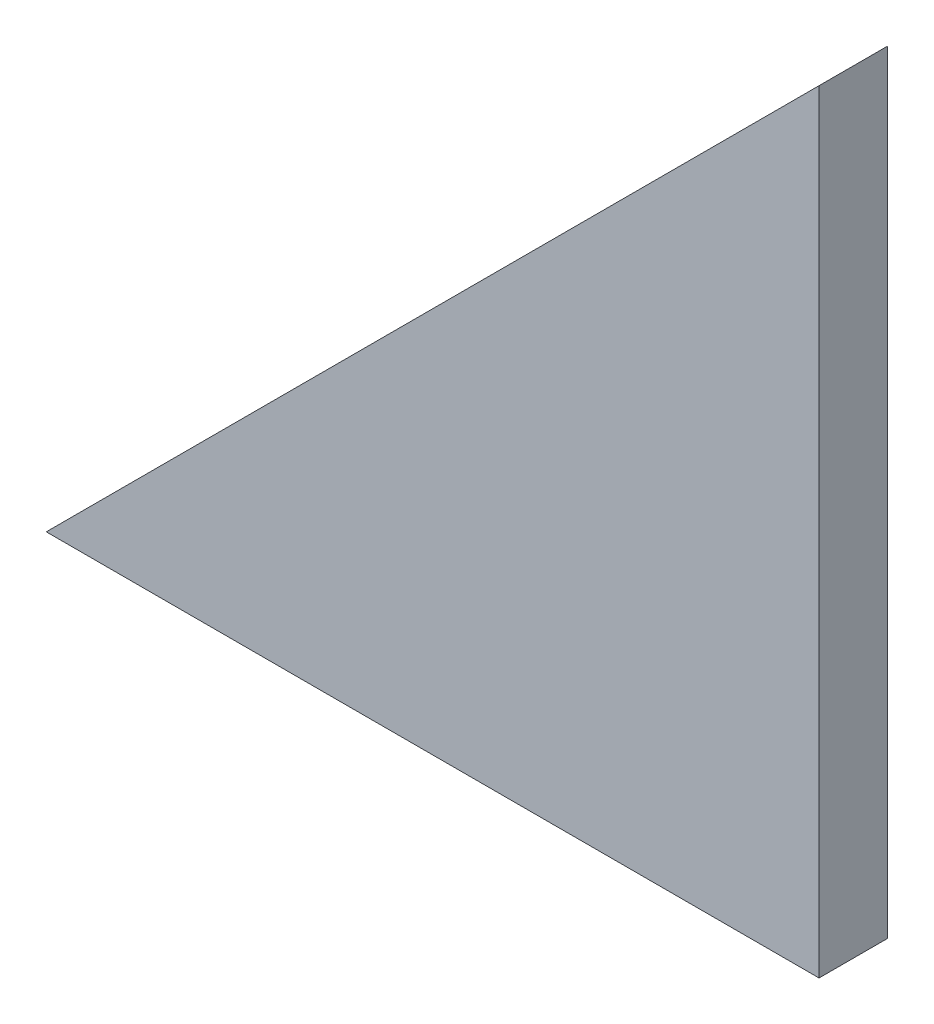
ISO-10303-21;
HEADER;
FILE_DESCRIPTION(('STEP AP214'),'2;1');
FILE_NAME('part.step','',(''),(''),'','','');
FILE_SCHEMA(('AUTOMOTIVE_DESIGN { 1 0 10303 214 1 1 1 1 }'));
ENDSEC;
DATA;
#1=APPLICATION_CONTEXT('core data for automotive mechanical design processes');
#2=APPLICATION_PROTOCOL_DEFINITION('international standard','automotive_design',2000,#1);
#3=PRODUCT_CONTEXT('',#1,'mechanical');
#4=PRODUCT('Part','Part','',(#3));
#5=PRODUCT_RELATED_PRODUCT_CATEGORY('part','',(#4));
#6=PRODUCT_DEFINITION_FORMATION('','',#4);
#7=PRODUCT_DEFINITION_CONTEXT('part definition',#1,'design');
#8=PRODUCT_DEFINITION('design','',#6,#7);
#9=PRODUCT_DEFINITION_SHAPE('','',#8);
#10=(LENGTH_UNIT() NAMED_UNIT(*) SI_UNIT(.MILLI.,.METRE.));
#11=(NAMED_UNIT(*) PLANE_ANGLE_UNIT() SI_UNIT($,.RADIAN.));
#12=(NAMED_UNIT(*) SI_UNIT($,.STERADIAN.) SOLID_ANGLE_UNIT());
#13=UNCERTAINTY_MEASURE_WITH_UNIT(LENGTH_MEASURE(1.E-05),#10,'distance_accuracy_value','');
#14=(GEOMETRIC_REPRESENTATION_CONTEXT(3) GLOBAL_UNCERTAINTY_ASSIGNED_CONTEXT((#13)) GLOBAL_UNIT_ASSIGNED_CONTEXT((#10,
#11,#12)) REPRESENTATION_CONTEXT('',''));
#15=CARTESIAN_POINT('',(0.,0.,0.));
#16=DIRECTION('',(0.,0.,1.));
#17=DIRECTION('',(1.,0.,0.));
#18=AXIS2_PLACEMENT_3D('',#15,#16,#17);
#19=CARTESIAN_POINT('',(90.,89.9999999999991,8.));
#20=DIRECTION('',(0.707106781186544,-0.707106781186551,0.));
#21=DIRECTION('',(0.707106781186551,0.707106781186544,0.));
#22=AXIS2_PLACEMENT_3D('',#19,#20,#21);
#23=PLANE('',#22);
#24=CARTESIAN_POINT('',(24.7487373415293,24.748737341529,4.));
#25=DIRECTION('',(-0.707106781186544,0.707106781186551,0.));
#26=DIRECTION('',(-0.707106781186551,-0.707106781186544,0.));
#27=AXIS2_PLACEMENT_3D('',#24,#25,#26);
#28=CIRCLE('',#27,2.1);
#29=CARTESIAN_POINT('',(23.2638131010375,23.2638131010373,4.));
#30=VERTEX_POINT('',#29);
#31=EDGE_CURVE('E125',#30,#30,#28,.T.);
#32=ORIENTED_EDGE('',*,*,#31,.F.);
#33=EDGE_LOOP('',(#32));
#34=FACE_BOUND('',#33,.T.);
#35=CARTESIAN_POINT('',(77.7817459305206,77.7817459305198,4.));
#36=DIRECTION('',(-0.707106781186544,0.707106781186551,0.));
#37=DIRECTION('',(-0.707106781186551,-0.707106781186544,0.));
#38=AXIS2_PLACEMENT_3D('',#35,#36,#37);
#39=CIRCLE('',#38,2.1);
#40=CARTESIAN_POINT('',(76.2968216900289,76.2968216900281,4.));
#41=VERTEX_POINT('',#40);
#42=EDGE_CURVE('E132',#41,#41,#39,.T.);
#43=ORIENTED_EDGE('',*,*,#42,.F.);
#44=EDGE_LOOP('',(#43));
#45=FACE_BOUND('',#44,.T.);
#46=DIRECTION('',(-0.707106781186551,-0.707106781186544,0.));
#47=VECTOR('',#46,1.);
#48=CARTESIAN_POINT('',(90.,89.9999999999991,0.));
#49=LINE('',#48,#47);
#50=CARTESIAN_POINT('',(90.,89.9999999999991,0.));
#51=VERTEX_POINT('',#50);
#52=CARTESIAN_POINT('',(0.,0.,0.));
#53=VERTEX_POINT('',#52);
#54=EDGE_CURVE('E138',#51,#53,#49,.T.);
#55=ORIENTED_EDGE('',*,*,#54,.T.);
#56=DIRECTION('',(0.,0.,-1.));
#57=VECTOR('',#56,1.);
#58=CARTESIAN_POINT('',(0.,0.,8.));
#59=LINE('',#58,#57);
#60=CARTESIAN_POINT('',(0.,0.,8.));
#61=VERTEX_POINT('',#60);
#62=EDGE_CURVE('E13',#61,#53,#59,.T.);
#63=ORIENTED_EDGE('',*,*,#62,.F.);
#64=DIRECTION('',(-0.707106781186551,-0.707106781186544,0.));
#65=VECTOR('',#64,1.);
#66=CARTESIAN_POINT('',(90.,89.9999999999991,8.));
#67=LINE('',#66,#65);
#68=CARTESIAN_POINT('',(90.,89.9999999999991,8.));
#69=VERTEX_POINT('',#68);
#70=EDGE_CURVE('E139',#69,#61,#67,.T.);
#71=ORIENTED_EDGE('',*,*,#70,.F.);
#72=DIRECTION('',(0.,0.,-1.));
#73=VECTOR('',#72,1.);
#74=CARTESIAN_POINT('',(90.,89.9999999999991,8.));
#75=LINE('',#74,#73);
#76=EDGE_CURVE('E144',#69,#51,#75,.T.);
#77=ORIENTED_EDGE('',*,*,#76,.T.);
#78=EDGE_LOOP('',(#55,#63,#71,#77));
#79=FACE_BOUND('',#78,.T.);
#80=ADVANCED_FACE('F54',(#34,#45,#79),#23,.F.);
#81=CARTESIAN_POINT('',(0.,0.,8.));
#82=DIRECTION('',(0.,1.,0.));
#83=DIRECTION('',(0.,0.,1.));
#84=AXIS2_PLACEMENT_3D('',#81,#82,#83);
#85=PLANE('',#84);
#86=CARTESIAN_POINT('',(25.5,0.,4.));
#87=DIRECTION('',(0.,-1.,0.));
#88=DIRECTION('',(0.,0.,-1.));
#89=AXIS2_PLACEMENT_3D('',#86,#87,#88);
#90=CIRCLE('',#89,2.09999999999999);
#91=CARTESIAN_POINT('',(25.5,0.,1.90000000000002));
#92=VERTEX_POINT('',#91);
#93=EDGE_CURVE('E115',#92,#92,#90,.T.);
#94=ORIENTED_EDGE('',*,*,#93,.F.);
#95=EDGE_LOOP('',(#94));
#96=FACE_BOUND('',#95,.T.);
#97=CARTESIAN_POINT('',(55.5,0.,4.00000000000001));
#98=DIRECTION('',(0.,-1.,0.));
#99=DIRECTION('',(0.,0.,-1.));
#100=AXIS2_PLACEMENT_3D('',#97,#98,#99);
#101=CIRCLE('',#100,2.09999999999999);
#102=CARTESIAN_POINT('',(55.5,0.,1.90000000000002));
#103=VERTEX_POINT('',#102);
#104=EDGE_CURVE('E114',#103,#103,#101,.T.);
#105=ORIENTED_EDGE('',*,*,#104,.F.);
#106=EDGE_LOOP('',(#105));
#107=FACE_BOUND('',#106,.T.);
#108=DIRECTION('',(1.,0.,0.));
#109=VECTOR('',#108,1.);
#110=CARTESIAN_POINT('',(0.,0.,0.));
#111=LINE('',#110,#109);
#112=CARTESIAN_POINT('',(90.,0.,0.));
#113=VERTEX_POINT('',#112);
#114=EDGE_CURVE('E83',#53,#113,#111,.T.);
#115=ORIENTED_EDGE('',*,*,#114,.T.);
#116=DIRECTION('',(0.,0.,-1.));
#117=VECTOR('',#116,1.);
#118=CARTESIAN_POINT('',(90.,0.,8.));
#119=LINE('',#118,#117);
#120=CARTESIAN_POINT('',(90.,0.,8.));
#121=VERTEX_POINT('',#120);
#122=EDGE_CURVE('E62',#121,#113,#119,.T.);
#123=ORIENTED_EDGE('',*,*,#122,.F.);
#124=DIRECTION('',(1.,0.,0.));
#125=VECTOR('',#124,1.);
#126=CARTESIAN_POINT('',(0.,0.,8.));
#127=LINE('',#126,#125);
#128=EDGE_CURVE('E91',#61,#121,#127,.T.);
#129=ORIENTED_EDGE('',*,*,#128,.F.);
#130=ORIENTED_EDGE('',*,*,#62,.T.);
#131=EDGE_LOOP('',(#115,#123,#129,#130));
#132=FACE_BOUND('',#131,.T.);
#133=ADVANCED_FACE('F166',(#96,#107,#132),#85,.F.);
#134=CARTESIAN_POINT('',(90.,0.,8.));
#135=DIRECTION('',(-1.,0.,0.));
#136=DIRECTION('',(0.,0.,1.));
#137=AXIS2_PLACEMENT_3D('',#134,#135,#136);
#138=PLANE('',#137);
#139=DIRECTION('',(0.,1.,0.));
#140=VECTOR('',#139,1.);
#141=CARTESIAN_POINT('',(90.,0.,0.));
#142=LINE('',#141,#140);
#143=EDGE_CURVE('E88',#113,#51,#142,.T.);
#144=ORIENTED_EDGE('',*,*,#143,.T.);
#145=ORIENTED_EDGE('',*,*,#76,.F.);
#146=DIRECTION('',(0.,1.,0.));
#147=VECTOR('',#146,1.);
#148=CARTESIAN_POINT('',(90.,0.,8.));
#149=LINE('',#148,#147);
#150=EDGE_CURVE('E70',#121,#69,#149,.T.);
#151=ORIENTED_EDGE('',*,*,#150,.F.);
#152=ORIENTED_EDGE('',*,*,#122,.T.);
#153=EDGE_LOOP('',(#144,#145,#151,#152));
#154=FACE_BOUND('',#153,.T.);
#155=ADVANCED_FACE('F150',(#154),#138,.F.);
#156=CARTESIAN_POINT('',(0.,0.,8.));
#157=DIRECTION('',(0.,0.,1.));
#158=DIRECTION('',(1.,0.,0.));
#159=AXIS2_PLACEMENT_3D('',#156,#157,#158);
#160=PLANE('',#159);
#161=ORIENTED_EDGE('',*,*,#70,.T.);
#162=ORIENTED_EDGE('',*,*,#128,.T.);
#163=ORIENTED_EDGE('',*,*,#150,.T.);
#164=EDGE_LOOP('',(#161,#162,#163));
#165=FACE_BOUND('',#164,.T.);
#166=ADVANCED_FACE('F157',(#165),#160,.T.);
#167=CARTESIAN_POINT('',(0.,0.,0.));
#168=DIRECTION('',(0.,0.,1.));
#169=DIRECTION('',(1.,0.,0.));
#170=AXIS2_PLACEMENT_3D('',#167,#168,#169);
#171=PLANE('',#170);
#172=ORIENTED_EDGE('',*,*,#54,.F.);
#173=ORIENTED_EDGE('',*,*,#143,.F.);
#174=ORIENTED_EDGE('',*,*,#114,.F.);
#175=EDGE_LOOP('',(#172,#173,#174));
#176=FACE_BOUND('',#175,.T.);
#177=ADVANCED_FACE('F153',(#176),#171,.F.);
#178=CARTESIAN_POINT('',(87.6812408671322,67.8822509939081,4.));
#179=DIRECTION('',(-0.707106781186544,0.707106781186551,0.));
#180=DIRECTION('',(-0.707106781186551,-0.707106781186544,0.));
#181=AXIS2_PLACEMENT_3D('',#178,#179,#180);
#182=CONICAL_SURFACE('',#181,2.1,1.02974425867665);
#183=CARTESIAN_POINT('',(88.5734733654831,66.9900184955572,4.));
#184=VERTEX_POINT('',#183);
#185=VERTEX_LOOP('',#184);
#186=FACE_BOUND('',#185,.T.);
#187=CARTESIAN_POINT('',(87.6812408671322,67.8822509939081,4.));
#188=DIRECTION('',(-0.707106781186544,0.707106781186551,0.));
#189=DIRECTION('',(-0.707106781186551,-0.707106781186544,0.));
#190=AXIS2_PLACEMENT_3D('',#187,#188,#189);
#191=CIRCLE('',#190,2.1);
#192=CARTESIAN_POINT('',(86.1963166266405,66.3973267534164,4.));
#193=VERTEX_POINT('',#192);
#194=EDGE_CURVE('E135',#193,#193,#191,.T.);
#195=ORIENTED_EDGE('',*,*,#194,.T.);
#196=EDGE_LOOP('',(#195));
#197=FACE_BOUND('',#196,.T.);
#198=ADVANCED_FACE('F164',(#186,#197),#182,.F.);
#199=CARTESIAN_POINT('',(77.7817459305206,77.7817459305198,4.));
#200=DIRECTION('',(-0.707106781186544,0.707106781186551,0.));
#201=DIRECTION('',(-0.707106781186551,-0.707106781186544,0.));
#202=AXIS2_PLACEMENT_3D('',#199,#200,#201);
#203=CYLINDRICAL_SURFACE('',#202,2.1);
#204=ORIENTED_EDGE('',*,*,#194,.F.);
#205=EDGE_LOOP('',(#204));
#206=FACE_BOUND('',#205,.T.);
#207=ORIENTED_EDGE('',*,*,#42,.T.);
#208=EDGE_LOOP('',(#207));
#209=FACE_BOUND('',#208,.T.);
#210=ADVANCED_FACE('F179',(#206,#209),#203,.F.);
#211=CARTESIAN_POINT('',(34.6482322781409,14.8492424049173,4.));
#212=DIRECTION('',(-0.707106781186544,0.707106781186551,0.));
#213=DIRECTION('',(-0.707106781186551,-0.707106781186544,0.));
#214=AXIS2_PLACEMENT_3D('',#211,#212,#213);
#215=CONICAL_SURFACE('',#214,2.1,1.02974425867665);
#216=CARTESIAN_POINT('',(35.5404647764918,13.9570099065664,4.));
#217=VERTEX_POINT('',#216);
#218=VERTEX_LOOP('',#217);
#219=FACE_BOUND('',#218,.T.);
#220=CARTESIAN_POINT('',(34.6482322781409,14.8492424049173,4.));
#221=DIRECTION('',(-0.707106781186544,0.707106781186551,0.));
#222=DIRECTION('',(-0.707106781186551,-0.707106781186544,0.));
#223=AXIS2_PLACEMENT_3D('',#220,#221,#222);
#224=CIRCLE('',#223,2.1);
#225=CARTESIAN_POINT('',(33.1633080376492,13.3643181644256,4.));
#226=VERTEX_POINT('',#225);
#227=EDGE_CURVE('E129',#226,#226,#224,.T.);
#228=ORIENTED_EDGE('',*,*,#227,.T.);
#229=EDGE_LOOP('',(#228));
#230=FACE_BOUND('',#229,.T.);
#231=ADVANCED_FACE('F181',(#219,#230),#215,.F.);
#232=CARTESIAN_POINT('',(24.7487373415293,24.748737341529,4.));
#233=DIRECTION('',(-0.707106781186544,0.707106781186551,0.));
#234=DIRECTION('',(-0.707106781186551,-0.707106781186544,0.));
#235=AXIS2_PLACEMENT_3D('',#232,#233,#234);
#236=CYLINDRICAL_SURFACE('',#235,2.1);
#237=ORIENTED_EDGE('',*,*,#227,.F.);
#238=EDGE_LOOP('',(#237));
#239=FACE_BOUND('',#238,.T.);
#240=ORIENTED_EDGE('',*,*,#31,.T.);
#241=EDGE_LOOP('',(#240));
#242=FACE_BOUND('',#241,.T.);
#243=ADVANCED_FACE('F188',(#239,#242),#236,.F.);
#244=CARTESIAN_POINT('',(55.5,14.,4.00000000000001));
#245=DIRECTION('',(0.,-1.,0.));
#246=DIRECTION('',(0.,0.,-1.));
#247=AXIS2_PLACEMENT_3D('',#244,#245,#246);
#248=CONICAL_SURFACE('',#247,2.09999999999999,1.02974425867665);
#249=CARTESIAN_POINT('',(55.5,15.2618072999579,4.00000000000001));
#250=VERTEX_POINT('',#249);
#251=VERTEX_LOOP('',#250);
#252=FACE_BOUND('',#251,.T.);
#253=CARTESIAN_POINT('',(55.5,14.,4.00000000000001));
#254=DIRECTION('',(0.,-1.,0.));
#255=DIRECTION('',(0.,0.,-1.));
#256=AXIS2_PLACEMENT_3D('',#253,#254,#255);
#257=CIRCLE('',#256,2.09999999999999);
#258=CARTESIAN_POINT('',(55.5,14.,1.90000000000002));
#259=VERTEX_POINT('',#258);
#260=EDGE_CURVE('E118',#259,#259,#257,.T.);
#261=ORIENTED_EDGE('',*,*,#260,.T.);
#262=EDGE_LOOP('',(#261));
#263=FACE_BOUND('',#262,.T.);
#264=ADVANCED_FACE('F196',(#252,#263),#248,.F.);
#265=CARTESIAN_POINT('',(55.5,0.,4.00000000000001));
#266=DIRECTION('',(0.,-1.,0.));
#267=DIRECTION('',(0.,0.,-1.));
#268=AXIS2_PLACEMENT_3D('',#265,#266,#267);
#269=CYLINDRICAL_SURFACE('',#268,2.09999999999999);
#270=ORIENTED_EDGE('',*,*,#260,.F.);
#271=EDGE_LOOP('',(#270));
#272=FACE_BOUND('',#271,.T.);
#273=ORIENTED_EDGE('',*,*,#104,.T.);
#274=EDGE_LOOP('',(#273));
#275=FACE_BOUND('',#274,.T.);
#276=ADVANCED_FACE('F108',(#272,#275),#269,.F.);
#277=CARTESIAN_POINT('',(25.5,14.,4.));
#278=DIRECTION('',(0.,-1.,0.));
#279=DIRECTION('',(0.,0.,-1.));
#280=AXIS2_PLACEMENT_3D('',#277,#278,#279);
#281=CONICAL_SURFACE('',#280,2.09999999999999,1.02974425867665);
#282=CARTESIAN_POINT('',(25.5,15.2618072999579,4.));
#283=VERTEX_POINT('',#282);
#284=VERTEX_LOOP('',#283);
#285=FACE_BOUND('',#284,.T.);
#286=CARTESIAN_POINT('',(25.5,14.,4.));
#287=DIRECTION('',(0.,-1.,0.));
#288=DIRECTION('',(0.,0.,-1.));
#289=AXIS2_PLACEMENT_3D('',#286,#287,#288);
#290=CIRCLE('',#289,2.09999999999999);
#291=CARTESIAN_POINT('',(25.5,14.,1.90000000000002));
#292=VERTEX_POINT('',#291);
#293=EDGE_CURVE('E112',#292,#292,#290,.T.);
#294=ORIENTED_EDGE('',*,*,#293,.T.);
#295=EDGE_LOOP('',(#294));
#296=FACE_BOUND('',#295,.T.);
#297=ADVANCED_FACE('F104',(#285,#296),#281,.F.);
#298=CARTESIAN_POINT('',(25.5,0.,4.));
#299=DIRECTION('',(0.,-1.,0.));
#300=DIRECTION('',(0.,0.,-1.));
#301=AXIS2_PLACEMENT_3D('',#298,#299,#300);
#302=CYLINDRICAL_SURFACE('',#301,2.09999999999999);
#303=ORIENTED_EDGE('',*,*,#293,.F.);
#304=EDGE_LOOP('',(#303));
#305=FACE_BOUND('',#304,.T.);
#306=ORIENTED_EDGE('',*,*,#93,.T.);
#307=EDGE_LOOP('',(#306));
#308=FACE_BOUND('',#307,.T.);
#309=ADVANCED_FACE('F107',(#305,#308),#302,.F.);
#310=CLOSED_SHELL('',(#80,#133,#155,#166,#177,#198,#210,#231,#243,#264,#276,#297,#309));
#311=MANIFOLD_SOLID_BREP('B2',#310);
#312=ADVANCED_BREP_SHAPE_REPRESENTATION('',(#18,#311),#14);
#313=SHAPE_DEFINITION_REPRESENTATION(#9,#312);
ENDSEC;
END-ISO-10303-21;
